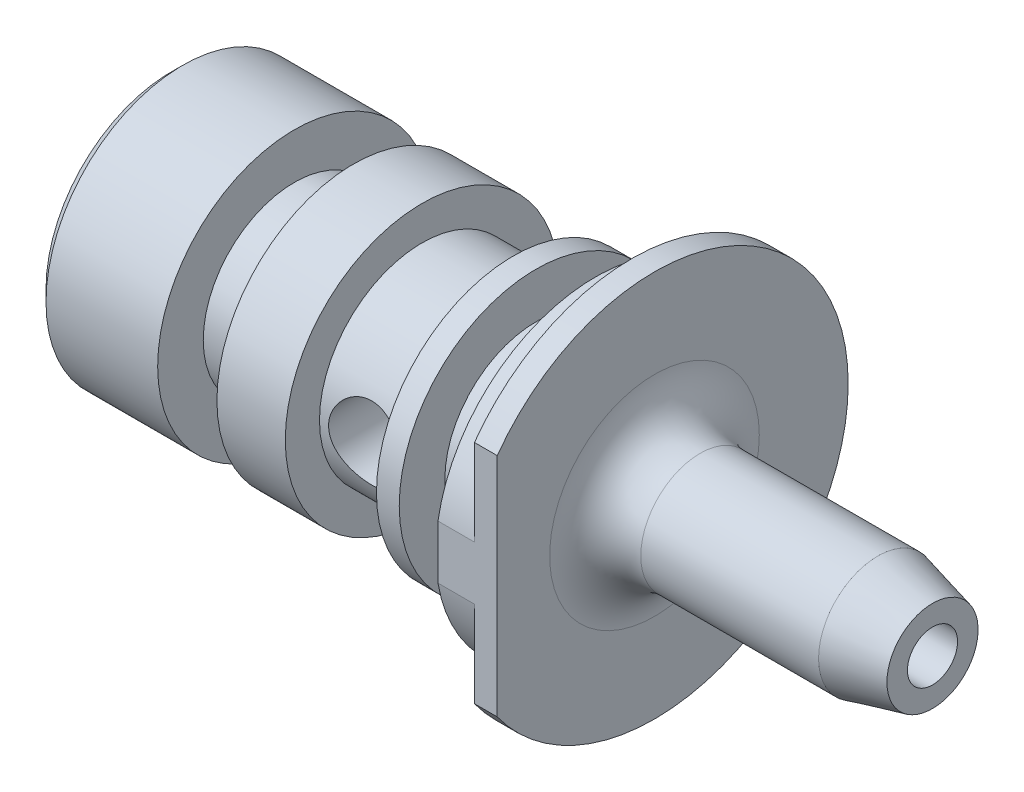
from build123d import *

# Parameters (mm, degrees)
ENL_V_MAT_EXTRU_1_DEPTH      = 18.748661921
ENL_V_MAT_EXTRU_1_DEPTH_BACK = 18.748661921
ESQUISSE2_R                  = 0.8
ESQUISSE3_W                  = 1.941222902
ESQUISSE3_H                  = 6.152689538
ENL_V_MAT_EXTRU_2_DEPTH      = 13.185442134
CONG_1_R                     = 1


with BuildPart() as part:
    # Esquisse1 → Base-R_volution (revolve)
    with BuildSketch(Plane(origin=(0, 0, 0), x_dir=(-1, 0, 0), z_dir=(0, 0, -1)), mode=Mode.PRIVATE) as base_r_volution_sk:
        Polygon((11.7, 0.55), (12.652627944, 0), (16.7, 0), (16.7, 2.75), (16.45, 3), (14, 3), (14, 2), (12.7, 2), (12.7, 3), (11.2, 3), (11.2, 2.25), (9.2, 2.25), (9.2, 3), (8.7, 3), (8.7, 2), (7.4, 2), (7.4, 3.5), (6.6, 3.5), (6.6, 4.25), (6.1, 4.25), (6.1, 1.3), (1.2, 1.3), (0, 1), (0, 0.55), align=None)
    revolve(base_r_volution_sk.sketch.rotate(Axis((0.001250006, 0, 0), (-1, 0, 0)), 270), axis=Axis((0.001250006, 0, 0), (-1, 0, 0)))

    # Esquisse2 → Enl_v. mat.-Extru.1 (cut, two sides: drawn at the far end of the back side and taken through both)
    with BuildSketch(Plane.XY.offset(-ENL_V_MAT_EXTRU_1_DEPTH_BACK)):
        with Locations((-10.2, 0)):
            Circle(ESQUISSE2_R)
    extrude(amount=ENL_V_MAT_EXTRU_1_DEPTH + ENL_V_MAT_EXTRU_1_DEPTH_BACK, mode=Mode.SUBTRACT)

    # Esquisse3 → Enl_v. mat.-Extru.2 (cut, through all)
    with BuildSketch(Plane(origin=(-6.1, 0, 0), x_dir=(0, 0, -1), z_dir=(1, 0, 0))):
        with Locations((-4.420611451, 0)):
            Rectangle(ESQUISSE3_W, ESQUISSE3_H)
    extrude(amount=-ENL_V_MAT_EXTRU_2_DEPTH, mode=Mode.SUBTRACT)

    # Cong_1
    cong_1_edges = [part.edges().sort_by_distance(p)[0] for p in [
        (-6.1, 0, -1.3),
    ]]
    fillet(cong_1_edges, radius=CONG_1_R)


solid = part.part
